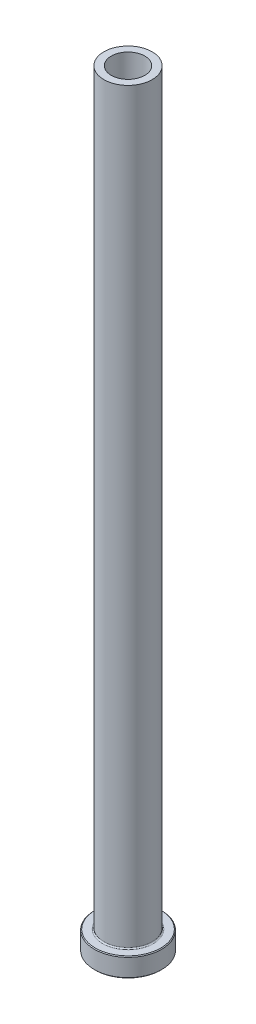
from build123d import *

# Parameters (mm, degrees)
CHAMFER1_SIZE = 0.254


with BuildPart() as part:
    # Sketch1 → Revolve1 (revolve)
    with BuildSketch(Plane.XY, mode=Mode.PRIVATE) as revolve1_sk:
        with BuildLine():
            Line((0, 0), (11.1125, 0))
            Line((11.1125, 0), (11.1125, 6.35))
            Line((11.1125, 6.35), (8.391525, 6.35))
            ThreePointArc((8.391525, 6.35), (8.110891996, 6.466241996), (7.99465, 6.746875))
            Line((7.99465, 6.746875), (7.99465, 254))
            Line((7.99465, 254), (0, 254))
            Line((0, 254), (0, 0))
        make_face()
    revolve(revolve1_sk.sketch.rotate(Axis((0, 0, 0), (0, 1, 0)), 90), axis=Axis((0, 0, 0), (0, 1, 0)))

    # Sketch2 → Cut-Revolve1 (revolve, cut)
    with BuildSketch(Plane.XY, mode=Mode.PRIVATE) as cut_revolve1_sk:
        Polygon((6.143625, 0), (5.74675, 0.396875), (5.74675, 179.5145), (5.55625, 193.802), (5.55625, 254), (0, 254), (0, 0), align=None)
    revolve(cut_revolve1_sk.sketch.rotate(Axis((0, 0, 0), (0, 1, 0)), 90), axis=Axis((0, 0, 0), (0, 1, 0)), mode=Mode.SUBTRACT)

    # Chamfer1
    chamfer1_edges = [part.edges().sort_by_distance(p)[0] for p in [
        (0, 6.35, 11.1125),
        (0, 0, 11.1125),
    ]]
    chamfer(chamfer1_edges, length=CHAMFER1_SIZE)


solid = part.part
